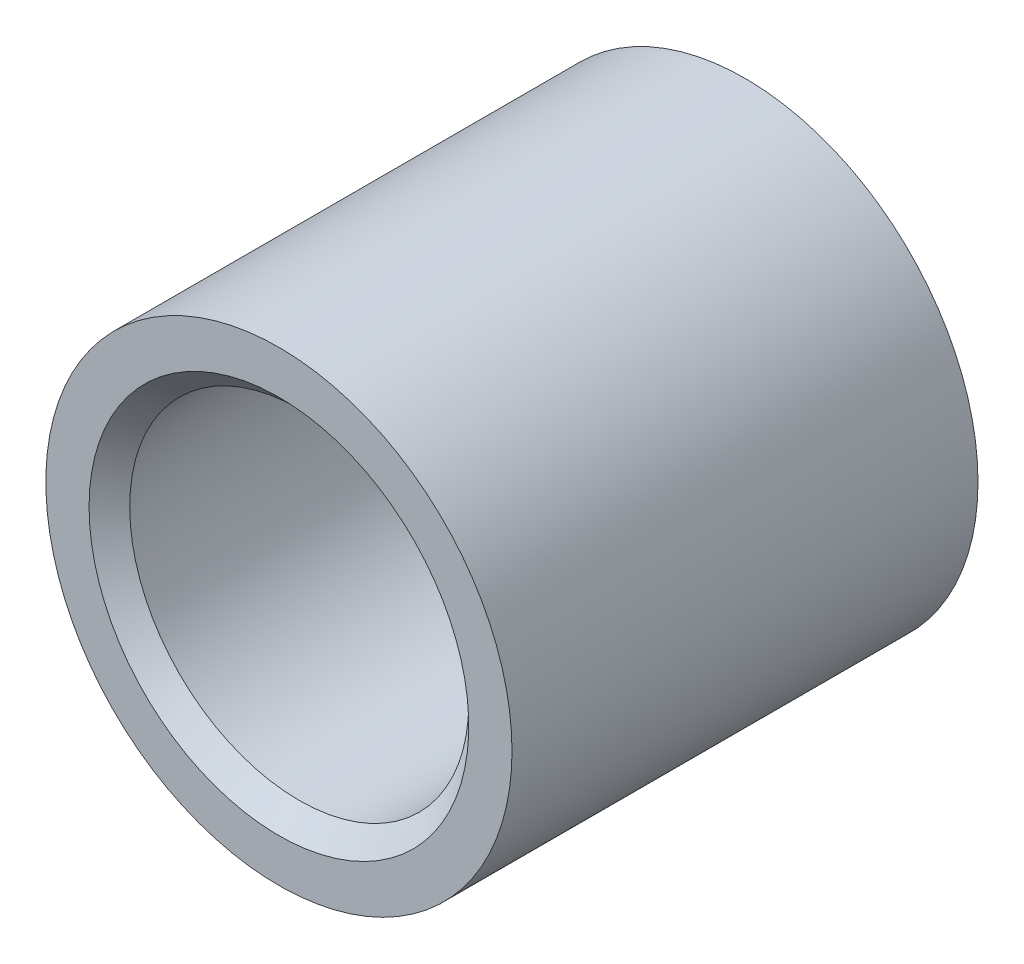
ISO-10303-21;
HEADER;
FILE_DESCRIPTION(('STEP AP214'),'2;1');
FILE_NAME('part.step','',(''),(''),'','','');
FILE_SCHEMA(('AUTOMOTIVE_DESIGN { 1 0 10303 214 1 1 1 1 }'));
ENDSEC;
DATA;
#1=APPLICATION_CONTEXT('core data for automotive mechanical design processes');
#2=APPLICATION_PROTOCOL_DEFINITION('international standard','automotive_design',2000,#1);
#3=PRODUCT_CONTEXT('',#1,'mechanical');
#4=PRODUCT('Part','Part','',(#3));
#5=PRODUCT_RELATED_PRODUCT_CATEGORY('part','',(#4));
#6=PRODUCT_DEFINITION_FORMATION('','',#4);
#7=PRODUCT_DEFINITION_CONTEXT('part definition',#1,'design');
#8=PRODUCT_DEFINITION('design','',#6,#7);
#9=PRODUCT_DEFINITION_SHAPE('','',#8);
#10=(LENGTH_UNIT() NAMED_UNIT(*) SI_UNIT(.MILLI.,.METRE.));
#11=(NAMED_UNIT(*) PLANE_ANGLE_UNIT() SI_UNIT($,.RADIAN.));
#12=(NAMED_UNIT(*) SI_UNIT($,.STERADIAN.) SOLID_ANGLE_UNIT());
#13=UNCERTAINTY_MEASURE_WITH_UNIT(LENGTH_MEASURE(1.E-05),#10,'distance_accuracy_value','');
#14=(GEOMETRIC_REPRESENTATION_CONTEXT(3) GLOBAL_UNCERTAINTY_ASSIGNED_CONTEXT((#13)) GLOBAL_UNIT_ASSIGNED_CONTEXT((#10,
#11,#12)) REPRESENTATION_CONTEXT('',''));
#15=CARTESIAN_POINT('',(0.,0.,0.));
#16=DIRECTION('',(0.,0.,1.));
#17=DIRECTION('',(1.,0.,0.));
#18=AXIS2_PLACEMENT_3D('',#15,#16,#17);
#19=CARTESIAN_POINT('',(0.,0.,31.775));
#20=DIRECTION('',(0.,0.,1.));
#21=DIRECTION('',(1.,0.,0.));
#22=AXIS2_PLACEMENT_3D('',#19,#20,#21);
#23=CYLINDRICAL_SURFACE('',#22,17.46885);
#24=CARTESIAN_POINT('',(0.,0.,0.));
#25=DIRECTION('',(0.,0.,1.));
#26=DIRECTION('',(1.,0.,0.));
#27=AXIS2_PLACEMENT_3D('',#24,#25,#26);
#28=CIRCLE('',#27,17.46885);
#29=CARTESIAN_POINT('',(17.46885,0.,0.));
#30=VERTEX_POINT('',#29);
#31=EDGE_CURVE('E32',#30,#30,#28,.T.);
#32=ORIENTED_EDGE('',*,*,#31,.F.);
#33=EDGE_LOOP('',(#32));
#34=FACE_BOUND('',#33,.T.);
#35=CARTESIAN_POINT('',(0.,0.,-34.925));
#36=DIRECTION('',(0.,0.,1.));
#37=DIRECTION('',(1.,0.,0.));
#38=AXIS2_PLACEMENT_3D('',#35,#36,#37);
#39=CIRCLE('',#38,17.46885);
#40=CARTESIAN_POINT('',(17.46885,0.,-34.925));
#41=VERTEX_POINT('',#40);
#42=EDGE_CURVE('E35',#41,#41,#39,.T.);
#43=ORIENTED_EDGE('',*,*,#42,.T.);
#44=EDGE_LOOP('',(#43));
#45=FACE_BOUND('',#44,.T.);
#46=ADVANCED_FACE('F13',(#34,#45),#23,.T.);
#47=CARTESIAN_POINT('',(17.46885,0.,0.));
#48=DIRECTION('',(0.,0.,-1.));
#49=DIRECTION('',(-1.,0.,0.));
#50=AXIS2_PLACEMENT_3D('',#47,#48,#49);
#51=PLANE('',#50);
#52=CARTESIAN_POINT('',(0.,0.,0.));
#53=DIRECTION('',(0.,0.,-1.));
#54=DIRECTION('',(-1.,0.,0.));
#55=AXIS2_PLACEMENT_3D('',#52,#53,#54);
#56=CIRCLE('',#55,14.23035);
#57=CARTESIAN_POINT('',(-14.23035,0.,0.));
#58=VERTEX_POINT('',#57);
#59=EDGE_CURVE('E9',#58,#58,#56,.T.);
#60=ORIENTED_EDGE('',*,*,#59,.T.);
#61=EDGE_LOOP('',(#60));
#62=FACE_BOUND('',#61,.T.);
#63=ORIENTED_EDGE('',*,*,#31,.T.);
#64=EDGE_LOOP('',(#63));
#65=FACE_BOUND('',#64,.T.);
#66=ADVANCED_FACE('F55',(#62,#65),#51,.F.);
#67=CARTESIAN_POINT('',(0.,0.,31.775));
#68=DIRECTION('',(0.,0.,1.));
#69=DIRECTION('',(1.,0.,0.));
#70=AXIS2_PLACEMENT_3D('',#67,#68,#69);
#71=CYLINDRICAL_SURFACE('',#70,12.70635);
#72=CARTESIAN_POINT('',(0.,0.,-33.401));
#73=DIRECTION('',(0.,0.,1.));
#74=DIRECTION('',(1.,0.,0.));
#75=AXIS2_PLACEMENT_3D('',#72,#73,#74);
#76=CIRCLE('',#75,12.70635);
#77=CARTESIAN_POINT('',(12.70635,0.,-33.401));
#78=VERTEX_POINT('',#77);
#79=EDGE_CURVE('E19',#78,#78,#76,.F.);
#80=ORIENTED_EDGE('',*,*,#79,.T.);
#81=EDGE_LOOP('',(#80));
#82=FACE_BOUND('',#81,.T.);
#83=CARTESIAN_POINT('',(0.,0.,-1.524));
#84=DIRECTION('',(0.,0.,-1.));
#85=DIRECTION('',(-1.,0.,0.));
#86=AXIS2_PLACEMENT_3D('',#83,#84,#85);
#87=CIRCLE('',#86,12.70635);
#88=CARTESIAN_POINT('',(-12.70635,0.,-1.524));
#89=VERTEX_POINT('',#88);
#90=EDGE_CURVE('E23',#89,#89,#87,.F.);
#91=ORIENTED_EDGE('',*,*,#90,.T.);
#92=EDGE_LOOP('',(#91));
#93=FACE_BOUND('',#92,.T.);
#94=ADVANCED_FACE('F43',(#82,#93),#71,.F.);
#95=CARTESIAN_POINT('',(12.70635,0.,-34.925));
#96=DIRECTION('',(0.,0.,1.));
#97=DIRECTION('',(1.,0.,0.));
#98=AXIS2_PLACEMENT_3D('',#95,#96,#97);
#99=PLANE('',#98);
#100=CARTESIAN_POINT('',(0.,0.,-34.925));
#101=DIRECTION('',(0.,0.,1.));
#102=DIRECTION('',(1.,0.,0.));
#103=AXIS2_PLACEMENT_3D('',#100,#101,#102);
#104=CIRCLE('',#103,14.23035);
#105=CARTESIAN_POINT('',(14.23035,0.,-34.925));
#106=VERTEX_POINT('',#105);
#107=EDGE_CURVE('E27',#106,#106,#104,.T.);
#108=ORIENTED_EDGE('',*,*,#107,.T.);
#109=EDGE_LOOP('',(#108));
#110=FACE_BOUND('',#109,.T.);
#111=ORIENTED_EDGE('',*,*,#42,.F.);
#112=EDGE_LOOP('',(#111));
#113=FACE_BOUND('',#112,.T.);
#114=ADVANCED_FACE('F40',(#110,#113),#99,.F.);
#115=CARTESIAN_POINT('',(0.,0.,-34.925));
#116=DIRECTION('',(0.,0.,-1.));
#117=DIRECTION('',(-1.,0.,0.));
#118=AXIS2_PLACEMENT_3D('',#115,#116,#117);
#119=CONICAL_SURFACE('',#118,14.23035,0.785398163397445);
#120=ORIENTED_EDGE('',*,*,#79,.F.);
#121=EDGE_LOOP('',(#120));
#122=FACE_BOUND('',#121,.T.);
#123=ORIENTED_EDGE('',*,*,#107,.F.);
#124=EDGE_LOOP('',(#123));
#125=FACE_BOUND('',#124,.T.);
#126=ADVANCED_FACE('F42',(#122,#125),#119,.F.);
#127=CARTESIAN_POINT('',(0.,0.,-1.524));
#128=DIRECTION('',(0.,0.,1.));
#129=DIRECTION('',(1.,0.,0.));
#130=AXIS2_PLACEMENT_3D('',#127,#128,#129);
#131=CONICAL_SURFACE('',#130,12.70635,0.785398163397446);
#132=ORIENTED_EDGE('',*,*,#59,.F.);
#133=EDGE_LOOP('',(#132));
#134=FACE_BOUND('',#133,.T.);
#135=ORIENTED_EDGE('',*,*,#90,.F.);
#136=EDGE_LOOP('',(#135));
#137=FACE_BOUND('',#136,.T.);
#138=ADVANCED_FACE('F52',(#134,#137),#131,.F.);
#139=CLOSED_SHELL('',(#46,#66,#94,#114,#126,#138));
#140=MANIFOLD_SOLID_BREP('B1',#139);
#141=ADVANCED_BREP_SHAPE_REPRESENTATION('',(#18,#140),#14);
#142=SHAPE_DEFINITION_REPRESENTATION(#9,#141);
ENDSEC;
END-ISO-10303-21;
